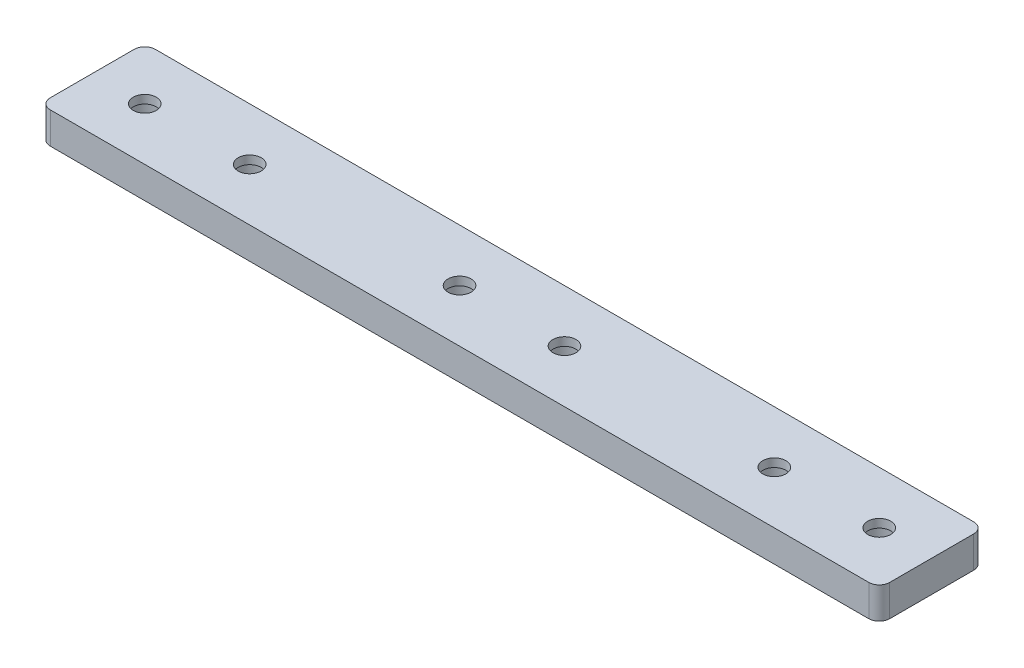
from build123d import *

# Parameters (mm, degrees)
EXTRUIR1_DEPTH                                       = 15
REFRENTADO_PARA_TORNILLO_DE_CABEZA_CIL_N_D           = 11
REFRENTADO_PARA_TORNILLO_DE_CABEZA_CIL_N_CBORE_D     = 18
REFRENTADO_PARA_TORNILLO_DE_CABEZA_CIL_N_CBORE_DEPTH = 11


with BuildPart() as part:
    # Croquis1 → Extruir1 (new body)
    with BuildSketch(Plane(origin=(0, 0, 0), x_dir=(1, 0, 0), z_dir=(0, 1, 0))):
        with BuildLine():
            Line((-195, 25), (195, 25))
            ThreePointArc((195, 25), (198.535533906, 23.535533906), (200, 20))
            Line((200, 20), (200, -20))
            ThreePointArc((200, -20), (198.535533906, -23.535533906), (195, -25))
            Line((195, -25), (-195, -25))
            ThreePointArc((-195, -25), (-198.535533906, -23.535533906), (-200, -20))
            Line((-200, -20), (-200, 20))
            ThreePointArc((-200, 20), (-198.535533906, 23.535533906), (-195, 25))
        make_face()
    extrude(amount=EXTRUIR1_DEPTH)

    # Refrentado para tornillo de cabeza cil_n (through all)
    with Locations(Plane(origin=(-175, 0, 0), x_dir=(0, 0, -1), z_dir=(0, -1, 0))):
        with Locations((0, 0), (0, 50), (0, 150), (0, 200), (0, 350), (0, 300)):
            CounterBoreHole(REFRENTADO_PARA_TORNILLO_DE_CABEZA_CIL_N_D / 2, REFRENTADO_PARA_TORNILLO_DE_CABEZA_CIL_N_CBORE_D / 2, REFRENTADO_PARA_TORNILLO_DE_CABEZA_CIL_N_CBORE_DEPTH)


solid = part.part
